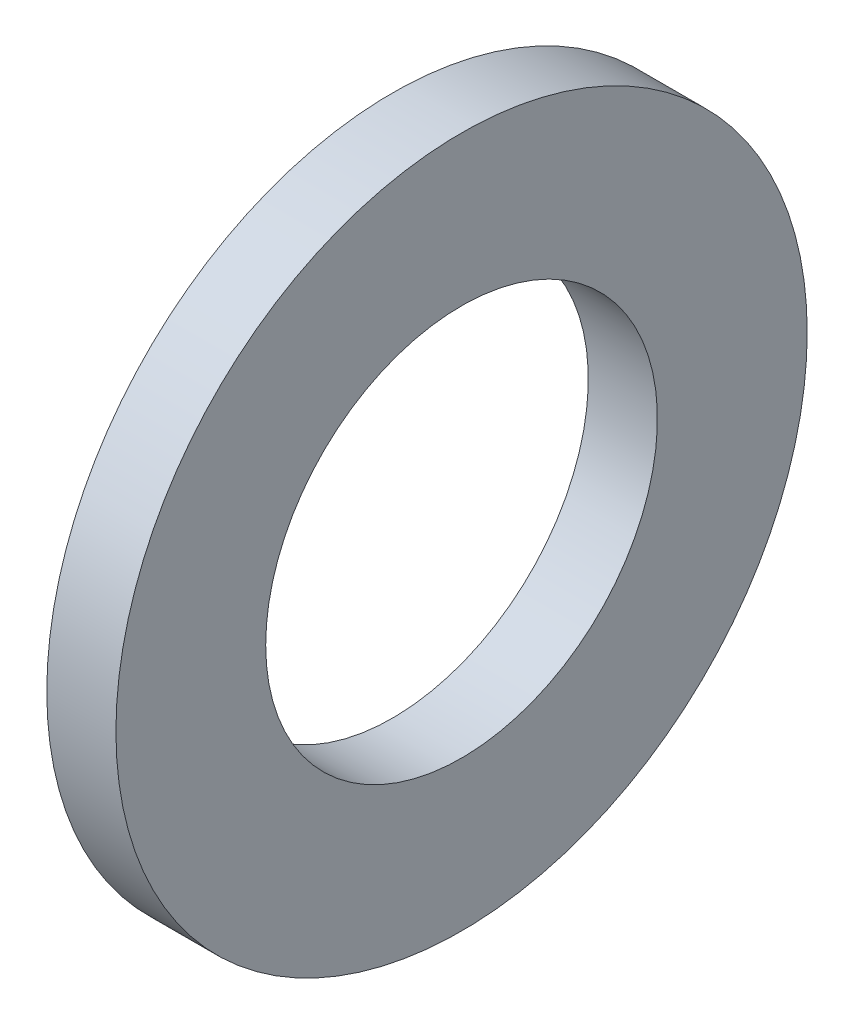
from build123d import *

# Parameters (mm, degrees)
ESQUISSE1_W = 3
ESQUISSE1_H = 6.5


with BuildPart() as part:
    # Esquisse1 → Base-R_volution (revolve)
    with BuildSketch(Plane(origin=(0, 0, 0), x_dir=(1, 0, 0), z_dir=(0, 1, 0)), mode=Mode.PRIVATE) as base_r_volution_sk:
        with Locations((1.5, 11.75)):
            Rectangle(ESQUISSE1_W, ESQUISSE1_H)
    revolve(base_r_volution_sk.sketch.rotate(Axis((0, 0, 0), (1, 0, 0)), 180), axis=Axis((0, 0, 0), (1, 0, 0)))


solid = part.part
